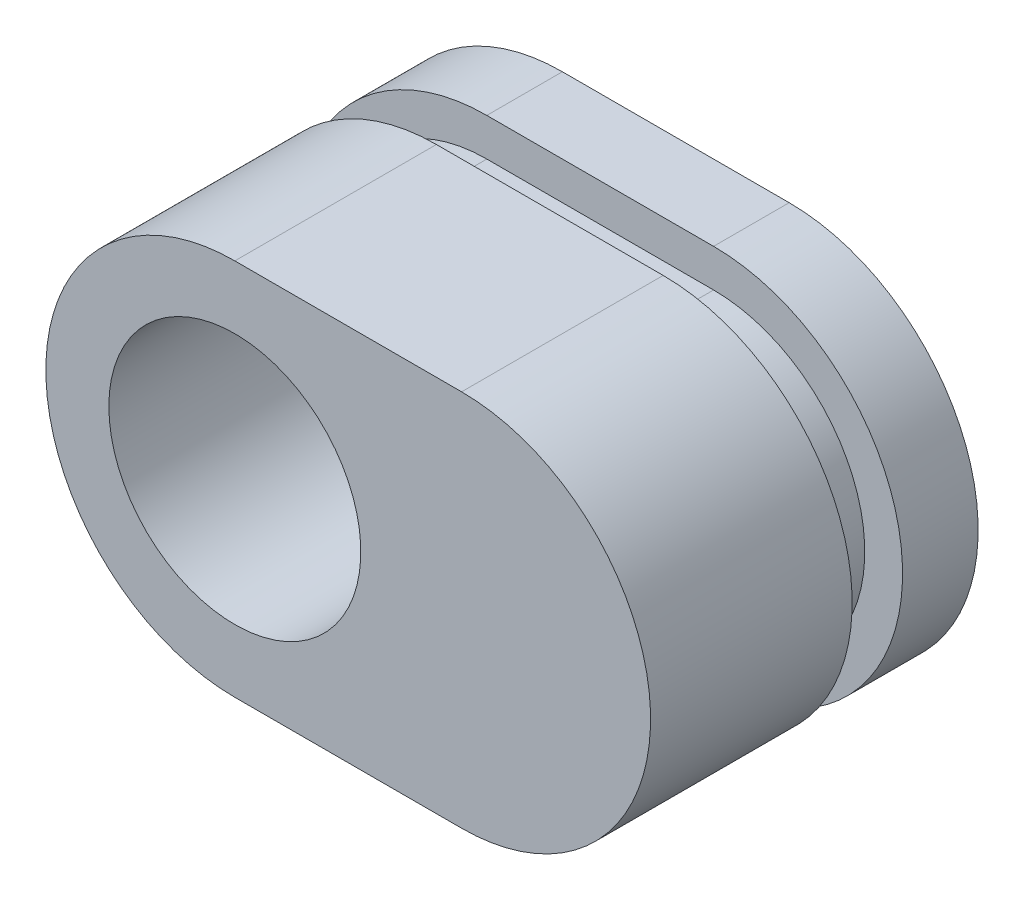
from build123d import *

# Parameters (mm, degrees)
SALIENTE_EXTRUIR1_DEPTH = 2
SALIENTE_EXTRUIR2_DEPTH = 8
SALIENTE_EXTRUIR3_START = 3
SALIENTE_EXTRUIR3_DEPTH = 3
CROQUIS4_R              = 5
CORTAR_EXTRUIR1_DEPTH   = 13


with BuildPart() as part:
    # Croquis1 → Saliente-Extruir1 (new body)
    with BuildSketch(Plane.XY):
        with BuildLine():
            Line((4.5, -6), (-4.5, -6))
            ThreePointArc((-4.5, -6), (-10.5, 0), (-4.5, 6))
            Line((-4.5, 6), (4.5, 6))
            ThreePointArc((4.5, 6), (10.5, 0), (4.5, -6))
        make_face()
    extrude(amount=SALIENTE_EXTRUIR1_DEPTH)

    # Croquis2 → Saliente-Extruir2 (add)
    with BuildSketch(Plane.XY.offset(2)):
        with BuildLine():
            Line((-4.5, 7.5), (4.5, 7.5))
            ThreePointArc((4.5, 7.5), (12, 0), (4.5, -7.5))
            Line((4.5, -7.5), (-4.5, -7.5))
            ThreePointArc((-4.5, -7.5), (-12, 0), (-4.5, 7.5))
        make_face()
    extrude(amount=SALIENTE_EXTRUIR2_DEPTH)

    # Croquis3 → Saliente-Extruir3 (add)
    with BuildSketch(Plane(origin=(0, 0, 0), x_dir=(-1, 0, 0), z_dir=(0, 0, -1)).offset(SALIENTE_EXTRUIR3_START)):
        with BuildLine():
            Line((-4.5, 7.5), (4.5, 7.5))
            ThreePointArc((4.5, 7.5), (12, 0), (4.5, -7.5))
            Line((4.5, -7.5), (-4.5, -7.5))
            ThreePointArc((-4.5, -7.5), (-12, 0), (-4.5, 7.5))
        make_face()
    extrude(amount=-SALIENTE_EXTRUIR3_DEPTH)

    # Croquis4 → Cortar-Extruir1 (cut)
    with BuildSketch(Plane(origin=(0, 0, -3), x_dir=(-1, 0, 0), z_dir=(0, 0, -1))):
        with Locations((4.5, 0)):
            Circle(CROQUIS4_R)
    extrude(amount=-CORTAR_EXTRUIR1_DEPTH, mode=Mode.SUBTRACT)


solid = part.part
